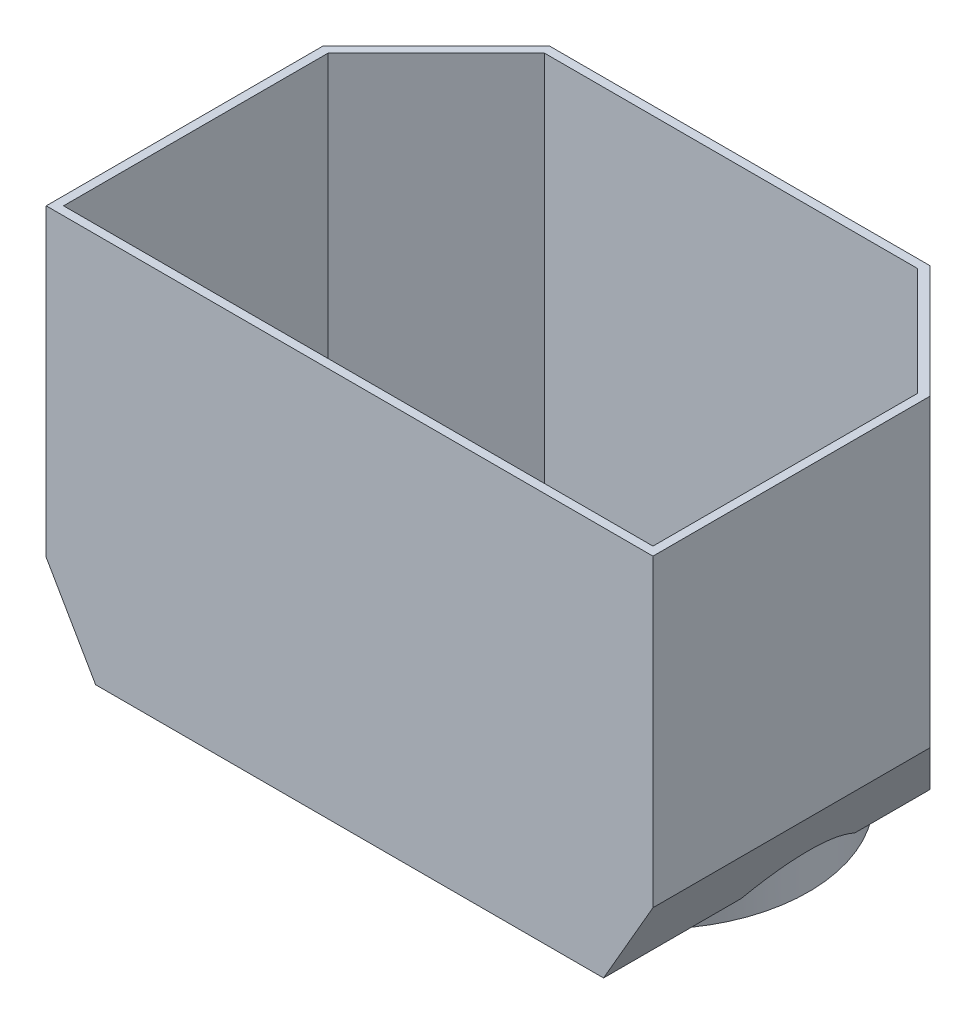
ISO-10303-21;
HEADER;
FILE_DESCRIPTION(('STEP AP214'),'2;1');
FILE_NAME('part.step','',(''),(''),'','','');
FILE_SCHEMA(('AUTOMOTIVE_DESIGN { 1 0 10303 214 1 1 1 1 }'));
ENDSEC;
DATA;
#1=APPLICATION_CONTEXT('core data for automotive mechanical design processes');
#2=APPLICATION_PROTOCOL_DEFINITION('international standard','automotive_design',2000,#1);
#3=PRODUCT_CONTEXT('',#1,'mechanical');
#4=PRODUCT('Part','Part','',(#3));
#5=PRODUCT_RELATED_PRODUCT_CATEGORY('part','',(#4));
#6=PRODUCT_DEFINITION_FORMATION('','',#4);
#7=PRODUCT_DEFINITION_CONTEXT('part definition',#1,'design');
#8=PRODUCT_DEFINITION('design','',#6,#7);
#9=PRODUCT_DEFINITION_SHAPE('','',#8);
#10=(LENGTH_UNIT() NAMED_UNIT(*) SI_UNIT(.MILLI.,.METRE.));
#11=(NAMED_UNIT(*) PLANE_ANGLE_UNIT() SI_UNIT($,.RADIAN.));
#12=(NAMED_UNIT(*) SI_UNIT($,.STERADIAN.) SOLID_ANGLE_UNIT());
#13=UNCERTAINTY_MEASURE_WITH_UNIT(LENGTH_MEASURE(1.E-05),#10,'distance_accuracy_value','');
#14=(GEOMETRIC_REPRESENTATION_CONTEXT(3) GLOBAL_UNCERTAINTY_ASSIGNED_CONTEXT((#13)) GLOBAL_UNIT_ASSIGNED_CONTEXT((#10,
#11,#12)) REPRESENTATION_CONTEXT('',''));
#15=CARTESIAN_POINT('',(0.,0.,0.));
#16=DIRECTION('',(0.,0.,1.));
#17=DIRECTION('',(1.,0.,0.));
#18=AXIS2_PLACEMENT_3D('',#15,#16,#17);
#19=CARTESIAN_POINT('',(140.,140.,180.));
#20=DIRECTION('',(-1.,0.,0.));
#21=DIRECTION('',(0.,-1.,0.));
#22=AXIS2_PLACEMENT_3D('',#19,#20,#21);
#23=PLANE('',#22);
#24=DIRECTION('',(0.,-1.,0.));
#25=VECTOR('',#24,1.);
#26=CARTESIAN_POINT('',(140.,140.,52.2530000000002));
#27=LINE('',#26,#25);
#28=CARTESIAN_POINT('',(140.,40.,52.2530000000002));
#29=VERTEX_POINT('',#28);
#30=CARTESIAN_POINT('',(140.,-100.503179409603,52.2530000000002));
#31=VERTEX_POINT('',#30);
#32=EDGE_CURVE('E387',#29,#31,#27,.T.);
#33=ORIENTED_EDGE('',*,*,#32,.F.);
#34=DIRECTION('',(0.,0.,-1.));
#35=VECTOR('',#34,1.);
#36=CARTESIAN_POINT('',(140.,40.,52.2530000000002));
#37=LINE('',#36,#35);
#38=CARTESIAN_POINT('',(140.,40.,180.));
#39=VERTEX_POINT('',#38);
#40=EDGE_CURVE('E174',#39,#29,#37,.T.);
#41=ORIENTED_EDGE('',*,*,#40,.F.);
#42=DIRECTION('',(0.,1.,0.));
#43=VECTOR('',#42,1.);
#44=CARTESIAN_POINT('',(140.,140.,180.));
#45=LINE('',#44,#43);
#46=CARTESIAN_POINT('',(140.,-100.503179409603,180.));
#47=VERTEX_POINT('',#46);
#48=EDGE_CURVE('E173',#47,#39,#45,.T.);
#49=ORIENTED_EDGE('',*,*,#48,.F.);
#50=DIRECTION('',(0.,0.,1.));
#51=VECTOR('',#50,1.);
#52=CARTESIAN_POINT('',(140.,-100.503179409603,0.));
#53=LINE('',#52,#51);
#54=EDGE_CURVE('E373',#31,#47,#53,.T.);
#55=ORIENTED_EDGE('',*,*,#54,.F.);
#56=EDGE_LOOP('',(#33,#41,#49,#55));
#57=FACE_BOUND('',#56,.T.);
#58=ADVANCED_FACE('F32',(#57),#23,.F.);
#59=CARTESIAN_POINT('',(-140.,140.,180.));
#60=DIRECTION('',(1.,0.,0.));
#61=DIRECTION('',(0.,1.,0.));
#62=AXIS2_PLACEMENT_3D('',#59,#60,#61);
#63=PLANE('',#62);
#64=DIRECTION('',(0.,-1.,0.));
#65=VECTOR('',#64,1.);
#66=CARTESIAN_POINT('',(-140.,140.,180.));
#67=LINE('',#66,#65);
#68=CARTESIAN_POINT('',(-140.,40.,180.));
#69=VERTEX_POINT('',#68);
#70=CARTESIAN_POINT('',(-140.,-100.503179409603,180.));
#71=VERTEX_POINT('',#70);
#72=EDGE_CURVE('E169',#69,#71,#67,.T.);
#73=ORIENTED_EDGE('',*,*,#72,.F.);
#74=DIRECTION('',(0.,0.,1.));
#75=VECTOR('',#74,1.);
#76=CARTESIAN_POINT('',(-140.,40.,180.));
#77=LINE('',#76,#75);
#78=CARTESIAN_POINT('',(-140.,40.,52.2530000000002));
#79=VERTEX_POINT('',#78);
#80=EDGE_CURVE('E155',#79,#69,#77,.T.);
#81=ORIENTED_EDGE('',*,*,#80,.F.);
#82=DIRECTION('',(0.,-1.,0.));
#83=VECTOR('',#82,1.);
#84=CARTESIAN_POINT('',(-140.,140.,52.2530000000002));
#85=LINE('',#84,#83);
#86=CARTESIAN_POINT('',(-140.,-100.503179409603,52.2530000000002));
#87=VERTEX_POINT('',#86);
#88=EDGE_CURVE('E191',#79,#87,#85,.T.);
#89=ORIENTED_EDGE('',*,*,#88,.T.);
#90=DIRECTION('',(0.,0.,1.));
#91=VECTOR('',#90,1.);
#92=CARTESIAN_POINT('',(-140.,-100.503179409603,0.));
#93=LINE('',#92,#91);
#94=EDGE_CURVE('E179',#87,#71,#93,.T.);
#95=ORIENTED_EDGE('',*,*,#94,.T.);
#96=EDGE_LOOP('',(#73,#81,#89,#95));
#97=FACE_BOUND('',#96,.T.);
#98=ADVANCED_FACE('F177',(#97),#63,.F.);
#99=CARTESIAN_POINT('',(-140.,-140.,180.));
#100=DIRECTION('',(0.,1.,0.));
#101=DIRECTION('',(0.,0.,1.));
#102=AXIS2_PLACEMENT_3D('',#99,#100,#101);
#103=PLANE('',#102);
#104=DIRECTION('',(0.,0.,1.));
#105=VECTOR('',#104,1.);
#106=CARTESIAN_POINT('',(117.1965,-140.,0.));
#107=LINE('',#106,#105);
#108=CARTESIAN_POINT('',(117.1965,-140.,29.4495000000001));
#109=VERTEX_POINT('',#108);
#110=CARTESIAN_POINT('',(117.1965,-140.,64.1311210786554));
#111=VERTEX_POINT('',#110);
#112=EDGE_CURVE('E367',#109,#111,#107,.T.);
#113=ORIENTED_EDGE('',*,*,#112,.T.);
#114=CARTESIAN_POINT('',(50.1205,-140.,90.3));
#115=DIRECTION('',(0.,-1.,0.));
#116=DIRECTION('',(0.,0.,-1.));
#117=AXIS2_PLACEMENT_3D('',#114,#115,#116);
#118=CIRCLE('',#117,72.);
#119=CARTESIAN_POINT('',(117.1965,-140.,116.468878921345));
#120=VERTEX_POINT('',#119);
#121=EDGE_CURVE('E356',#120,#111,#118,.T.);
#122=ORIENTED_EDGE('',*,*,#121,.F.);
#123=CARTESIAN_POINT('',(117.1965,-140.,180.));
#124=VERTEX_POINT('',#123);
#125=EDGE_CURVE('E376',#120,#124,#107,.T.);
#126=ORIENTED_EDGE('',*,*,#125,.T.);
#127=DIRECTION('',(1.,0.,0.));
#128=VECTOR('',#127,1.);
#129=CARTESIAN_POINT('',(-140.,-140.,180.));
#130=LINE('',#129,#128);
#131=CARTESIAN_POINT('',(-117.1965,-140.,180.));
#132=VERTEX_POINT('',#131);
#133=EDGE_CURVE('E180',#132,#124,#130,.T.);
#134=ORIENTED_EDGE('',*,*,#133,.F.);
#135=DIRECTION('',(0.,0.,1.));
#136=VECTOR('',#135,1.);
#137=CARTESIAN_POINT('',(-117.1965,-140.,0.));
#138=LINE('',#137,#136);
#139=CARTESIAN_POINT('',(-117.1965,-140.,29.4495000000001));
#140=VERTEX_POINT('',#139);
#141=EDGE_CURVE('E366',#140,#132,#138,.T.);
#142=ORIENTED_EDGE('',*,*,#141,.F.);
#143=DIRECTION('',(-0.707106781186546,0.,0.707106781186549));
#144=VECTOR('',#143,1.);
#145=CARTESIAN_POINT('',(-43.8735000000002,-140.,-43.8735));
#146=LINE('',#145,#144);
#147=CARTESIAN_POINT('',(-87.747,-140.,0.));
#148=VERTEX_POINT('',#147);
#149=EDGE_CURVE('E378',#148,#140,#146,.T.);
#150=ORIENTED_EDGE('',*,*,#149,.F.);
#151=DIRECTION('',(1.,0.,0.));
#152=VECTOR('',#151,1.);
#153=CARTESIAN_POINT('',(-140.,-140.,0.));
#154=LINE('',#153,#152);
#155=CARTESIAN_POINT('',(87.747,-140.,0.));
#156=VERTEX_POINT('',#155);
#157=EDGE_CURVE('E185',#148,#156,#154,.T.);
#158=ORIENTED_EDGE('',*,*,#157,.T.);
#159=DIRECTION('',(-0.707106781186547,0.,-0.707106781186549));
#160=VECTOR('',#159,1.);
#161=CARTESIAN_POINT('',(43.8735000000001,-140.,-43.8735));
#162=LINE('',#161,#160);
#163=EDGE_CURVE('E369',#109,#156,#162,.T.);
#164=ORIENTED_EDGE('',*,*,#163,.F.);
#165=EDGE_LOOP('',(#113,#122,#126,#134,#142,#150,#158,#164));
#166=FACE_BOUND('',#165,.T.);
#167=ADVANCED_FACE('F217',(#166),#103,.F.);
#168=CARTESIAN_POINT('',(0.,0.,180.));
#169=DIRECTION('',(0.,0.,1.));
#170=DIRECTION('',(1.,0.,0.));
#171=AXIS2_PLACEMENT_3D('',#168,#169,#170);
#172=PLANE('',#171);
#173=DIRECTION('',(1.,0.,0.));
#174=VECTOR('',#173,1.);
#175=CARTESIAN_POINT('',(140.,40.,180.));
#176=LINE('',#175,#174);
#177=EDGE_CURVE('E158',#69,#39,#176,.T.);
#178=ORIENTED_EDGE('',*,*,#177,.F.);
#179=ORIENTED_EDGE('',*,*,#72,.T.);
#180=DIRECTION('',(-0.499999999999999,0.866025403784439,0.));
#181=VECTOR('',#180,1.);
#182=CARTESIAN_POINT('',(-148.519153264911,-85.7475731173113,180.));
#183=LINE('',#182,#181);
#184=EDGE_CURVE('E364',#132,#71,#183,.T.);
#185=ORIENTED_EDGE('',*,*,#184,.F.);
#186=ORIENTED_EDGE('',*,*,#133,.T.);
#187=DIRECTION('',(-0.499999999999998,-0.86602540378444,0.));
#188=VECTOR('',#187,1.);
#189=CARTESIAN_POINT('',(148.519153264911,-85.747573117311,180.));
#190=LINE('',#189,#188);
#191=EDGE_CURVE('E363',#47,#124,#190,.T.);
#192=ORIENTED_EDGE('',*,*,#191,.F.);
#193=ORIENTED_EDGE('',*,*,#48,.T.);
#194=EDGE_LOOP('',(#178,#179,#185,#186,#192,#193));
#195=FACE_BOUND('',#194,.T.);
#196=ADVANCED_FACE('F167',(#195),#172,.T.);
#197=CARTESIAN_POINT('',(0.,0.,0.));
#198=DIRECTION('',(0.,0.,1.));
#199=DIRECTION('',(1.,0.,0.));
#200=AXIS2_PLACEMENT_3D('',#197,#198,#199);
#201=PLANE('',#200);
#202=DIRECTION('',(0.,-1.,0.));
#203=VECTOR('',#202,1.);
#204=CARTESIAN_POINT('',(-87.747,140.,0.));
#205=LINE('',#204,#203);
#206=CARTESIAN_POINT('',(-87.747,40.,0.));
#207=VERTEX_POINT('',#206);
#208=EDGE_CURVE('E381',#207,#148,#205,.T.);
#209=ORIENTED_EDGE('',*,*,#208,.F.);
#210=DIRECTION('',(-1.,0.,0.));
#211=VECTOR('',#210,1.);
#212=CARTESIAN_POINT('',(-87.747,40.,0.));
#213=LINE('',#212,#211);
#214=CARTESIAN_POINT('',(87.747,40.,0.));
#215=VERTEX_POINT('',#214);
#216=EDGE_CURVE('E47',#215,#207,#213,.T.);
#217=ORIENTED_EDGE('',*,*,#216,.F.);
#218=DIRECTION('',(0.,-1.,0.));
#219=VECTOR('',#218,1.);
#220=CARTESIAN_POINT('',(87.747,140.,0.));
#221=LINE('',#220,#219);
#222=EDGE_CURVE('E382',#215,#156,#221,.T.);
#223=ORIENTED_EDGE('',*,*,#222,.T.);
#224=ORIENTED_EDGE('',*,*,#157,.F.);
#225=EDGE_LOOP('',(#209,#217,#223,#224));
#226=FACE_BOUND('',#225,.T.);
#227=ADVANCED_FACE('F224',(#226),#201,.F.);
#228=CARTESIAN_POINT('',(43.8735000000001,140.,-43.8735));
#229=DIRECTION('',(-0.707106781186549,0.,0.707106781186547));
#230=DIRECTION('',(0.707106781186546,0.,0.707106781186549));
#231=AXIS2_PLACEMENT_3D('',#228,#229,#230);
#232=PLANE('',#231);
#233=ORIENTED_EDGE('',*,*,#222,.F.);
#234=DIRECTION('',(-0.707106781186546,0.,-0.707106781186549));
#235=VECTOR('',#234,1.);
#236=CARTESIAN_POINT('',(87.747,40.,0.));
#237=LINE('',#236,#235);
#238=EDGE_CURVE('E392',#29,#215,#237,.T.);
#239=ORIENTED_EDGE('',*,*,#238,.F.);
#240=ORIENTED_EDGE('',*,*,#32,.T.);
#241=DIRECTION('',(-0.447213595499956,-0.774596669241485,-0.447213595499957));
#242=VECTOR('',#241,1.);
#243=CARTESIAN_POINT('',(184.862145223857,-22.7996645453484,97.1151452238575));
#244=LINE('',#243,#242);
#245=EDGE_CURVE('E194',#31,#109,#244,.T.);
#246=ORIENTED_EDGE('',*,*,#245,.T.);
#247=ORIENTED_EDGE('',*,*,#163,.T.);
#248=EDGE_LOOP('',(#233,#239,#240,#246,#247));
#249=FACE_BOUND('',#248,.T.);
#250=ADVANCED_FACE('F227',(#249),#232,.F.);
#251=CARTESIAN_POINT('',(-43.8735000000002,140.,-43.8735));
#252=DIRECTION('',(0.707106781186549,0.,0.707106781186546));
#253=DIRECTION('',(0.707106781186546,0.,-0.707106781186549));
#254=AXIS2_PLACEMENT_3D('',#251,#252,#253);
#255=PLANE('',#254);
#256=ORIENTED_EDGE('',*,*,#88,.F.);
#257=DIRECTION('',(-0.707106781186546,0.,0.707106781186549));
#258=VECTOR('',#257,1.);
#259=CARTESIAN_POINT('',(-140.,40.,52.2530000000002));
#260=LINE('',#259,#258);
#261=EDGE_CURVE('E160',#207,#79,#260,.T.);
#262=ORIENTED_EDGE('',*,*,#261,.F.);
#263=ORIENTED_EDGE('',*,*,#208,.T.);
#264=ORIENTED_EDGE('',*,*,#149,.T.);
#265=DIRECTION('',(-0.447213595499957,0.774596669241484,0.447213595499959));
#266=VECTOR('',#265,1.);
#267=CARTESIAN_POINT('',(-184.862145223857,-22.799664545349,97.1151452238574));
#268=LINE('',#267,#266);
#269=EDGE_CURVE('E183',#140,#87,#268,.T.);
#270=ORIENTED_EDGE('',*,*,#269,.T.);
#271=EDGE_LOOP('',(#256,#262,#263,#264,#270));
#272=FACE_BOUND('',#271,.T.);
#273=ADVANCED_FACE('F233',(#272),#255,.F.);
#274=CARTESIAN_POINT('',(-148.519153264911,-85.7475731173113,0.));
#275=DIRECTION('',(0.866025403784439,0.499999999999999,0.));
#276=DIRECTION('',(-0.499999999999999,0.866025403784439,0.));
#277=AXIS2_PLACEMENT_3D('',#274,#275,#276);
#278=PLANE('',#277);
#279=ORIENTED_EDGE('',*,*,#141,.T.);
#280=ORIENTED_EDGE('',*,*,#184,.T.);
#281=ORIENTED_EDGE('',*,*,#94,.F.);
#282=ORIENTED_EDGE('',*,*,#269,.F.);
#283=EDGE_LOOP('',(#279,#280,#281,#282));
#284=FACE_BOUND('',#283,.T.);
#285=ADVANCED_FACE('F237',(#284),#278,.F.);
#286=CARTESIAN_POINT('',(148.519153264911,-85.747573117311,0.));
#287=DIRECTION('',(-0.86602540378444,0.499999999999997,0.));
#288=DIRECTION('',(-0.499999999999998,-0.86602540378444,0.));
#289=AXIS2_PLACEMENT_3D('',#286,#287,#288);
#290=PLANE('',#289);
#291=ORIENTED_EDGE('',*,*,#125,.F.);
#292=CARTESIAN_POINT('',(50.1205,-256.179039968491,90.3));
#293=DIRECTION('',(-0.86602540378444,0.499999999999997,0.));
#294=DIRECTION('',(-0.499999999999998,-0.86602540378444,0.));
#295=AXIS2_PLACEMENT_3D('',#292,#293,#294);
#296=ELLIPSE('',#295,144.000000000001,72.);
#297=EDGE_CURVE('E360',#111,#120,#296,.F.);
#298=ORIENTED_EDGE('',*,*,#297,.F.);
#299=ORIENTED_EDGE('',*,*,#112,.F.);
#300=ORIENTED_EDGE('',*,*,#245,.F.);
#301=ORIENTED_EDGE('',*,*,#54,.T.);
#302=ORIENTED_EDGE('',*,*,#191,.T.);
#303=EDGE_LOOP('',(#291,#298,#299,#300,#301,#302));
#304=FACE_BOUND('',#303,.T.);
#305=ADVANCED_FACE('F239',(#304),#290,.F.);
#306=CARTESIAN_POINT('',(50.1205,140.002,90.3));
#307=DIRECTION('',(0.,-1.,0.));
#308=DIRECTION('',(0.,0.,-1.));
#309=AXIS2_PLACEMENT_3D('',#306,#307,#308);
#310=CYLINDRICAL_SURFACE('',#309,68.);
#311=CARTESIAN_POINT('',(50.1205,-147.,90.3));
#312=DIRECTION('',(0.,-1.,0.));
#313=DIRECTION('',(0.,0.,-1.));
#314=AXIS2_PLACEMENT_3D('',#311,#312,#313);
#315=CIRCLE('',#314,68.);
#316=CARTESIAN_POINT('',(50.1205,-147.,22.3));
#317=VERTEX_POINT('',#316);
#318=EDGE_CURVE('E40',#317,#317,#315,.T.);
#319=ORIENTED_EDGE('',*,*,#318,.T.);
#320=EDGE_LOOP('',(#319));
#321=FACE_BOUND('',#320,.T.);
#322=CARTESIAN_POINT('',(50.1205,-136.,90.3));
#323=DIRECTION('',(0.,1.,0.));
#324=DIRECTION('',(0.,0.,1.));
#325=AXIS2_PLACEMENT_3D('',#322,#323,#324);
#326=CIRCLE('',#325,68.);
#327=CARTESIAN_POINT('',(114.887098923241,-136.,111.019258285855));
#328=VERTEX_POINT('',#327);
#329=CARTESIAN_POINT('',(114.887098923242,-136.,69.5807417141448));
#330=VERTEX_POINT('',#329);
#331=EDGE_CURVE('E301',#328,#330,#326,.F.);
#332=ORIENTED_EDGE('',*,*,#331,.F.);
#333=CARTESIAN_POINT('',(50.1205,-248.179039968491,90.3));
#334=DIRECTION('',(-0.86602540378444,0.499999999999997,0.));
#335=DIRECTION('',(-0.499999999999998,-0.86602540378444,0.));
#336=AXIS2_PLACEMENT_3D('',#333,#334,#335);
#337=ELLIPSE('',#336,136.000000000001,68.);
#338=EDGE_CURVE('E336',#330,#328,#337,.F.);
#339=ORIENTED_EDGE('',*,*,#338,.F.);
#340=EDGE_LOOP('',(#332,#339));
#341=FACE_BOUND('',#340,.T.);
#342=ADVANCED_FACE('F201',(#321,#341),#310,.F.);
#343=CARTESIAN_POINT('',(50.1205,140.002,90.3));
#344=DIRECTION('',(0.,-1.,0.));
#345=DIRECTION('',(0.,0.,-1.));
#346=AXIS2_PLACEMENT_3D('',#343,#344,#345);
#347=CYLINDRICAL_SURFACE('',#346,72.);
#348=ORIENTED_EDGE('',*,*,#297,.T.);
#349=ORIENTED_EDGE('',*,*,#121,.T.);
#350=EDGE_LOOP('',(#348,#349));
#351=FACE_BOUND('',#350,.T.);
#352=CARTESIAN_POINT('',(50.1205,-148.,90.3));
#353=DIRECTION('',(0.,-1.,0.));
#354=DIRECTION('',(0.,0.,-1.));
#355=AXIS2_PLACEMENT_3D('',#352,#353,#354);
#356=CIRCLE('',#355,72.);
#357=CARTESIAN_POINT('',(50.1205,-148.,18.3));
#358=VERTEX_POINT('',#357);
#359=EDGE_CURVE('E357',#358,#358,#356,.T.);
#360=ORIENTED_EDGE('',*,*,#359,.F.);
#361=EDGE_LOOP('',(#360));
#362=FACE_BOUND('',#361,.T.);
#363=ADVANCED_FACE('F246',(#351,#362),#347,.T.);
#364=CARTESIAN_POINT('',(50.1205,-148.,90.3));
#365=DIRECTION('',(0.,-1.,0.));
#366=DIRECTION('',(0.,0.,-1.));
#367=AXIS2_PLACEMENT_3D('',#364,#365,#366);
#368=PLANE('',#367);
#369=CARTESIAN_POINT('',(50.1205,-148.,90.3));
#370=DIRECTION('',(0.,-1.,0.));
#371=DIRECTION('',(0.,0.,-1.));
#372=AXIS2_PLACEMENT_3D('',#369,#370,#371);
#373=CIRCLE('',#372,69.0000000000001);
#374=CARTESIAN_POINT('',(50.1205,-148.,21.2999999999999));
#375=VERTEX_POINT('',#374);
#376=EDGE_CURVE('E11',#375,#375,#373,.F.);
#377=ORIENTED_EDGE('',*,*,#376,.T.);
#378=EDGE_LOOP('',(#377));
#379=FACE_BOUND('',#378,.T.);
#380=ORIENTED_EDGE('',*,*,#359,.T.);
#381=EDGE_LOOP('',(#380));
#382=FACE_BOUND('',#381,.T.);
#383=ADVANCED_FACE('F249',(#379,#382),#368,.T.);
#384=CARTESIAN_POINT('',(136.,140.,180.));
#385=DIRECTION('',(-1.,0.,0.));
#386=DIRECTION('',(0.,-1.,0.));
#387=AXIS2_PLACEMENT_3D('',#384,#385,#386);
#388=PLANE('',#387);
#389=DIRECTION('',(0.,0.,1.));
#390=VECTOR('',#389,1.);
#391=CARTESIAN_POINT('',(136.,40.,180.));
#392=LINE('',#391,#390);
#393=CARTESIAN_POINT('',(136.,40.,53.9098542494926));
#394=VERTEX_POINT('',#393);
#395=CARTESIAN_POINT('',(136.,40.,176.));
#396=VERTEX_POINT('',#395);
#397=EDGE_CURVE('E294',#394,#396,#392,.T.);
#398=ORIENTED_EDGE('',*,*,#397,.F.);
#399=DIRECTION('',(0.,-1.,0.));
#400=VECTOR('',#399,1.);
#401=CARTESIAN_POINT('',(136.,140.,53.9098542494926));
#402=LINE('',#401,#400);
#403=CARTESIAN_POINT('',(136.,-99.4313826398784,53.9098542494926));
#404=VERTEX_POINT('',#403);
#405=EDGE_CURVE('E296',#394,#404,#402,.T.);
#406=ORIENTED_EDGE('',*,*,#405,.T.);
#407=DIRECTION('',(0.,0.,1.));
#408=VECTOR('',#407,1.);
#409=CARTESIAN_POINT('',(136.,-99.4313826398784,0.));
#410=LINE('',#409,#408);
#411=CARTESIAN_POINT('',(136.,-99.4313826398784,176.));
#412=VERTEX_POINT('',#411);
#413=EDGE_CURVE('E321',#404,#412,#410,.T.);
#414=ORIENTED_EDGE('',*,*,#413,.T.);
#415=DIRECTION('',(0.,1.,0.));
#416=VECTOR('',#415,1.);
#417=CARTESIAN_POINT('',(136.,140.,176.));
#418=LINE('',#417,#416);
#419=EDGE_CURVE('E299',#412,#396,#418,.T.);
#420=ORIENTED_EDGE('',*,*,#419,.T.);
#421=EDGE_LOOP('',(#398,#406,#414,#420));
#422=FACE_BOUND('',#421,.T.);
#423=ADVANCED_FACE('F255',(#422),#388,.T.);
#424=CARTESIAN_POINT('',(-136.,140.,180.));
#425=DIRECTION('',(1.,0.,0.));
#426=DIRECTION('',(0.,1.,0.));
#427=AXIS2_PLACEMENT_3D('',#424,#425,#426);
#428=PLANE('',#427);
#429=DIRECTION('',(0.,0.,-1.));
#430=VECTOR('',#429,1.);
#431=CARTESIAN_POINT('',(-136.,40.,180.));
#432=LINE('',#431,#430);
#433=CARTESIAN_POINT('',(-136.,40.,176.));
#434=VERTEX_POINT('',#433);
#435=CARTESIAN_POINT('',(-136.,40.,53.9098542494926));
#436=VERTEX_POINT('',#435);
#437=EDGE_CURVE('E55',#434,#436,#432,.T.);
#438=ORIENTED_EDGE('',*,*,#437,.F.);
#439=DIRECTION('',(0.,-1.,0.));
#440=VECTOR('',#439,1.);
#441=CARTESIAN_POINT('',(-136.,140.,176.));
#442=LINE('',#441,#440);
#443=CARTESIAN_POINT('',(-136.,-99.4313826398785,176.));
#444=VERTEX_POINT('',#443);
#445=EDGE_CURVE('E332',#434,#444,#442,.T.);
#446=ORIENTED_EDGE('',*,*,#445,.T.);
#447=DIRECTION('',(0.,0.,1.));
#448=VECTOR('',#447,1.);
#449=CARTESIAN_POINT('',(-136.,-99.4313826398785,180.));
#450=LINE('',#449,#448);
#451=CARTESIAN_POINT('',(-136.,-99.4313826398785,53.9098542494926));
#452=VERTEX_POINT('',#451);
#453=EDGE_CURVE('E317',#452,#444,#450,.T.);
#454=ORIENTED_EDGE('',*,*,#453,.F.);
#455=DIRECTION('',(0.,-1.,0.));
#456=VECTOR('',#455,1.);
#457=CARTESIAN_POINT('',(-136.,140.,53.9098542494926));
#458=LINE('',#457,#456);
#459=EDGE_CURVE('E338',#436,#452,#458,.T.);
#460=ORIENTED_EDGE('',*,*,#459,.F.);
#461=EDGE_LOOP('',(#438,#446,#454,#460));
#462=FACE_BOUND('',#461,.T.);
#463=ADVANCED_FACE('F280',(#462),#428,.T.);
#464=CARTESIAN_POINT('',(0.,0.,176.));
#465=DIRECTION('',(0.,0.,1.));
#466=DIRECTION('',(1.,0.,0.));
#467=AXIS2_PLACEMENT_3D('',#464,#465,#466);
#468=PLANE('',#467);
#469=ORIENTED_EDGE('',*,*,#445,.F.);
#470=DIRECTION('',(1.,0.,0.));
#471=VECTOR('',#470,1.);
#472=CARTESIAN_POINT('',(0.,40.,176.));
#473=LINE('',#472,#471);
#474=EDGE_CURVE('E302',#434,#396,#473,.T.);
#475=ORIENTED_EDGE('',*,*,#474,.T.);
#476=ORIENTED_EDGE('',*,*,#419,.F.);
#477=DIRECTION('',(-0.499999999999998,-0.86602540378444,0.));
#478=VECTOR('',#477,1.);
#479=CARTESIAN_POINT('',(145.055051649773,-83.747573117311,176.));
#480=LINE('',#479,#478);
#481=CARTESIAN_POINT('',(114.887098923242,-136.,176.));
#482=VERTEX_POINT('',#481);
#483=EDGE_CURVE('E333',#412,#482,#480,.T.);
#484=ORIENTED_EDGE('',*,*,#483,.T.);
#485=DIRECTION('',(1.,0.,0.));
#486=VECTOR('',#485,1.);
#487=CARTESIAN_POINT('',(-140.,-136.,176.));
#488=LINE('',#487,#486);
#489=CARTESIAN_POINT('',(-114.887098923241,-136.,176.));
#490=VERTEX_POINT('',#489);
#491=EDGE_CURVE('E328',#490,#482,#488,.T.);
#492=ORIENTED_EDGE('',*,*,#491,.F.);
#493=DIRECTION('',(-0.499999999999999,0.866025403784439,0.));
#494=VECTOR('',#493,1.);
#495=CARTESIAN_POINT('',(-145.055051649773,-83.7475731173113,176.));
#496=LINE('',#495,#494);
#497=EDGE_CURVE('E323',#490,#444,#496,.T.);
#498=ORIENTED_EDGE('',*,*,#497,.T.);
#499=EDGE_LOOP('',(#469,#475,#476,#484,#492,#498));
#500=FACE_BOUND('',#499,.T.);
#501=ADVANCED_FACE('F276',(#500),#468,.F.);
#502=CARTESIAN_POINT('',(0.,0.,4.));
#503=DIRECTION('',(0.,0.,1.));
#504=DIRECTION('',(1.,0.,0.));
#505=AXIS2_PLACEMENT_3D('',#502,#503,#504);
#506=PLANE('',#505);
#507=DIRECTION('',(1.,0.,0.));
#508=VECTOR('',#507,1.);
#509=CARTESIAN_POINT('',(0.,40.,4.));
#510=LINE('',#509,#508);
#511=CARTESIAN_POINT('',(-86.0901457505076,40.,4.));
#512=VERTEX_POINT('',#511);
#513=CARTESIAN_POINT('',(86.0901457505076,40.,4.));
#514=VERTEX_POINT('',#513);
#515=EDGE_CURVE('E401',#512,#514,#510,.T.);
#516=ORIENTED_EDGE('',*,*,#515,.F.);
#517=DIRECTION('',(0.,-1.,0.));
#518=VECTOR('',#517,1.);
#519=CARTESIAN_POINT('',(-86.0901457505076,140.,4.));
#520=LINE('',#519,#518);
#521=CARTESIAN_POINT('',(-86.0901457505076,-136.,4.));
#522=VERTEX_POINT('',#521);
#523=EDGE_CURVE('E341',#512,#522,#520,.T.);
#524=ORIENTED_EDGE('',*,*,#523,.T.);
#525=DIRECTION('',(1.,0.,0.));
#526=VECTOR('',#525,1.);
#527=CARTESIAN_POINT('',(-140.,-136.,4.));
#528=LINE('',#527,#526);
#529=CARTESIAN_POINT('',(86.0901457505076,-136.,4.));
#530=VERTEX_POINT('',#529);
#531=EDGE_CURVE('E340',#522,#530,#528,.T.);
#532=ORIENTED_EDGE('',*,*,#531,.T.);
#533=DIRECTION('',(0.,-1.,0.));
#534=VECTOR('',#533,1.);
#535=CARTESIAN_POINT('',(86.0901457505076,0.,4.));
#536=LINE('',#535,#534);
#537=EDGE_CURVE('E311',#514,#530,#536,.T.);
#538=ORIENTED_EDGE('',*,*,#537,.F.);
#539=EDGE_LOOP('',(#516,#524,#532,#538));
#540=FACE_BOUND('',#539,.T.);
#541=ADVANCED_FACE('F272',(#540),#506,.T.);
#542=CARTESIAN_POINT('',(41.0450728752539,140.,-41.0450728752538));
#543=DIRECTION('',(-0.707106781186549,0.,0.707106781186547));
#544=DIRECTION('',(0.707106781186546,0.,0.707106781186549));
#545=AXIS2_PLACEMENT_3D('',#542,#543,#544);
#546=PLANE('',#545);
#547=DIRECTION('',(0.707106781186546,0.,0.707106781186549));
#548=VECTOR('',#547,1.);
#549=CARTESIAN_POINT('',(41.0450728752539,40.,-41.0450728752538));
#550=LINE('',#549,#548);
#551=EDGE_CURVE('E305',#514,#394,#550,.T.);
#552=ORIENTED_EDGE('',*,*,#551,.F.);
#553=ORIENTED_EDGE('',*,*,#537,.T.);
#554=DIRECTION('',(-0.707106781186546,0.,-0.707106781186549));
#555=VECTOR('',#554,1.);
#556=CARTESIAN_POINT('',(41.0450728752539,-136.,-41.0450728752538));
#557=LINE('',#556,#555);
#558=CARTESIAN_POINT('',(114.887098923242,-136.,32.796953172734));
#559=VERTEX_POINT('',#558);
#560=EDGE_CURVE('E312',#559,#530,#557,.T.);
#561=ORIENTED_EDGE('',*,*,#560,.F.);
#562=DIRECTION('',(-0.447213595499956,-0.774596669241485,-0.447213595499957));
#563=VECTOR('',#562,1.);
#564=CARTESIAN_POINT('',(180.959493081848,-21.559256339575,98.8693473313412));
#565=LINE('',#564,#563);
#566=EDGE_CURVE('E309',#404,#559,#565,.T.);
#567=ORIENTED_EDGE('',*,*,#566,.F.);
#568=ORIENTED_EDGE('',*,*,#405,.F.);
#569=EDGE_LOOP('',(#552,#553,#561,#567,#568));
#570=FACE_BOUND('',#569,.T.);
#571=ADVANCED_FACE('F268',(#570),#546,.T.);
#572=CARTESIAN_POINT('',(-41.045072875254,140.,-41.0450728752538));
#573=DIRECTION('',(0.707106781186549,0.,0.707106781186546));
#574=DIRECTION('',(0.707106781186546,0.,-0.707106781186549));
#575=AXIS2_PLACEMENT_3D('',#572,#573,#574);
#576=PLANE('',#575);
#577=DIRECTION('',(0.707106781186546,0.,-0.707106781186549));
#578=VECTOR('',#577,1.);
#579=CARTESIAN_POINT('',(-41.045072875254,40.,-41.0450728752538));
#580=LINE('',#579,#578);
#581=EDGE_CURVE('E197',#436,#512,#580,.T.);
#582=ORIENTED_EDGE('',*,*,#581,.F.);
#583=ORIENTED_EDGE('',*,*,#459,.T.);
#584=DIRECTION('',(-0.447213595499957,0.774596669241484,0.447213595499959));
#585=VECTOR('',#584,1.);
#586=CARTESIAN_POINT('',(-180.959493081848,-21.5592563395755,98.8693473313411));
#587=LINE('',#586,#585);
#588=CARTESIAN_POINT('',(-114.887098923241,-136.,32.796953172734));
#589=VERTEX_POINT('',#588);
#590=EDGE_CURVE('E331',#589,#452,#587,.T.);
#591=ORIENTED_EDGE('',*,*,#590,.F.);
#592=DIRECTION('',(-0.707106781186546,0.,0.707106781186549));
#593=VECTOR('',#592,1.);
#594=CARTESIAN_POINT('',(-41.045072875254,-136.,-41.0450728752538));
#595=LINE('',#594,#593);
#596=EDGE_CURVE('E314',#522,#589,#595,.T.);
#597=ORIENTED_EDGE('',*,*,#596,.F.);
#598=ORIENTED_EDGE('',*,*,#523,.F.);
#599=EDGE_LOOP('',(#582,#583,#591,#597,#598));
#600=FACE_BOUND('',#599,.T.);
#601=ADVANCED_FACE('F264',(#600),#576,.T.);
#602=CARTESIAN_POINT('',(-145.055051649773,-83.7475731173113,0.));
#603=DIRECTION('',(0.866025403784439,0.499999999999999,0.));
#604=DIRECTION('',(-0.499999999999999,0.866025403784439,0.));
#605=AXIS2_PLACEMENT_3D('',#602,#603,#604);
#606=PLANE('',#605);
#607=DIRECTION('',(0.,0.,1.));
#608=VECTOR('',#607,1.);
#609=CARTESIAN_POINT('',(-114.887098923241,-136.,0.));
#610=LINE('',#609,#608);
#611=EDGE_CURVE('E326',#589,#490,#610,.T.);
#612=ORIENTED_EDGE('',*,*,#611,.F.);
#613=ORIENTED_EDGE('',*,*,#590,.T.);
#614=ORIENTED_EDGE('',*,*,#453,.T.);
#615=ORIENTED_EDGE('',*,*,#497,.F.);
#616=EDGE_LOOP('',(#612,#613,#614,#615));
#617=FACE_BOUND('',#616,.T.);
#618=ADVANCED_FACE('F260',(#617),#606,.T.);
#619=CARTESIAN_POINT('',(145.055051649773,-83.747573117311,0.));
#620=DIRECTION('',(-0.86602540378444,0.499999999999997,0.));
#621=DIRECTION('',(-0.499999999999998,-0.86602540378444,0.));
#622=AXIS2_PLACEMENT_3D('',#619,#620,#621);
#623=PLANE('',#622);
#624=ORIENTED_EDGE('',*,*,#338,.T.);
#625=DIRECTION('',(0.,0.,1.));
#626=VECTOR('',#625,1.);
#627=CARTESIAN_POINT('',(114.887098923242,-136.,180.));
#628=LINE('',#627,#626);
#629=EDGE_CURVE('E351',#328,#482,#628,.T.);
#630=ORIENTED_EDGE('',*,*,#629,.T.);
#631=ORIENTED_EDGE('',*,*,#483,.F.);
#632=ORIENTED_EDGE('',*,*,#413,.F.);
#633=ORIENTED_EDGE('',*,*,#566,.T.);
#634=EDGE_CURVE('E327',#559,#330,#628,.T.);
#635=ORIENTED_EDGE('',*,*,#634,.T.);
#636=EDGE_LOOP('',(#624,#630,#631,#632,#633,#635));
#637=FACE_BOUND('',#636,.T.);
#638=ADVANCED_FACE('F257',(#637),#623,.T.);
#639=CARTESIAN_POINT('',(-140.,-136.,180.));
#640=DIRECTION('',(0.,1.,0.));
#641=DIRECTION('',(0.,0.,1.));
#642=AXIS2_PLACEMENT_3D('',#639,#640,#641);
#643=PLANE('',#642);
#644=ORIENTED_EDGE('',*,*,#331,.T.);
#645=ORIENTED_EDGE('',*,*,#634,.F.);
#646=ORIENTED_EDGE('',*,*,#560,.T.);
#647=ORIENTED_EDGE('',*,*,#531,.F.);
#648=ORIENTED_EDGE('',*,*,#596,.T.);
#649=ORIENTED_EDGE('',*,*,#611,.T.);
#650=ORIENTED_EDGE('',*,*,#491,.T.);
#651=ORIENTED_EDGE('',*,*,#629,.F.);
#652=EDGE_LOOP('',(#644,#645,#646,#647,#648,#649,#650,#651));
#653=FACE_BOUND('',#652,.T.);
#654=ADVANCED_FACE('F209',(#653),#643,.T.);
#655=CARTESIAN_POINT('',(0.,40.,0.));
#656=DIRECTION('',(0.,-1.,0.));
#657=DIRECTION('',(0.,0.,-1.));
#658=AXIS2_PLACEMENT_3D('',#655,#656,#657);
#659=PLANE('',#658);
#660=ORIENTED_EDGE('',*,*,#397,.T.);
#661=ORIENTED_EDGE('',*,*,#474,.F.);
#662=ORIENTED_EDGE('',*,*,#437,.T.);
#663=ORIENTED_EDGE('',*,*,#581,.T.);
#664=ORIENTED_EDGE('',*,*,#515,.T.);
#665=ORIENTED_EDGE('',*,*,#551,.T.);
#666=EDGE_LOOP('',(#660,#661,#662,#663,#664,#665));
#667=FACE_BOUND('',#666,.T.);
#668=ORIENTED_EDGE('',*,*,#80,.T.);
#669=ORIENTED_EDGE('',*,*,#177,.T.);
#670=ORIENTED_EDGE('',*,*,#40,.T.);
#671=ORIENTED_EDGE('',*,*,#238,.T.);
#672=ORIENTED_EDGE('',*,*,#216,.T.);
#673=ORIENTED_EDGE('',*,*,#261,.T.);
#674=EDGE_LOOP('',(#668,#669,#670,#671,#672,#673));
#675=FACE_BOUND('',#674,.T.);
#676=ADVANCED_FACE('F157',(#667,#675),#659,.F.);
#677=CARTESIAN_POINT('',(50.1205,-147.,90.3));
#678=DIRECTION('',(0.,-1.,0.));
#679=DIRECTION('',(0.,0.,-1.));
#680=AXIS2_PLACEMENT_3D('',#677,#678,#679);
#681=CONICAL_SURFACE('',#680,68.,0.785398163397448);
#682=ORIENTED_EDGE('',*,*,#376,.F.);
#683=EDGE_LOOP('',(#682));
#684=FACE_BOUND('',#683,.T.);
#685=ORIENTED_EDGE('',*,*,#318,.F.);
#686=EDGE_LOOP('',(#685));
#687=FACE_BOUND('',#686,.T.);
#688=ADVANCED_FACE('F34',(#684,#687),#681,.F.);
#689=CLOSED_SHELL('',(#58,#98,#167,#196,#227,#250,#273,#285,#305,#342,#363,#383,#423,#463,#501,
#541,#571,#601,#618,#638,#654,#676,#688));
#690=MANIFOLD_SOLID_BREP('B2',#689);
#691=ADVANCED_BREP_SHAPE_REPRESENTATION('',(#18,#690),#14);
#692=SHAPE_DEFINITION_REPRESENTATION(#9,#691);
ENDSEC;
END-ISO-10303-21;
